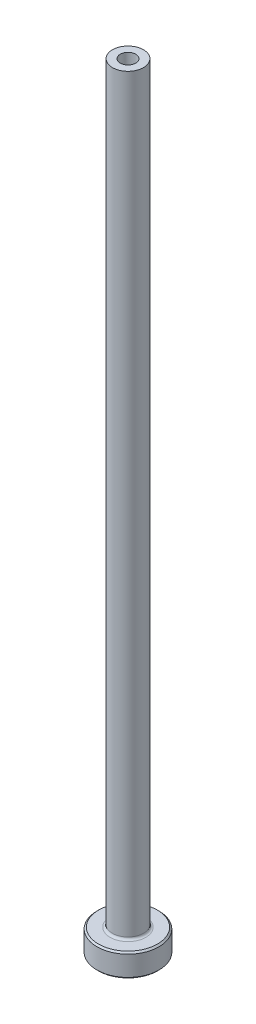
from build123d import *

# Parameters (mm, degrees)
FILLET1_R     = 0.3
CHAMFER1_SIZE = 0.2
CHAMFER3_SIZE = 0.5


with BuildPart() as part:
    # Sketch1 → Revolve1 (revolve)
    with BuildSketch(Plane.XY, mode=Mode.PRIVATE) as revolve1_sk:
        Polygon((-1, 100), (-2, 100), (-2, 3), (-4, 3), (-4, 0), (-1.25, 0), (-1.25, 53), (-1, 65), align=None)
    revolve(revolve1_sk.sketch.rotate(Axis((0, 92.187680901, 0), (0, -1, 0)), 270), axis=Axis((0, 92.187680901, 0), (0, -1, 0)))

    # Fillet1
    fillet1_edges = [part.edges().sort_by_distance(p)[0] for p in [
        (0, 3, -2),
    ]]
    fillet(fillet1_edges, radius=FILLET1_R)

    # Chamfer1
    chamfer1_edges = [part.edges().sort_by_distance(p)[0] for p in [
        (0, 0, -4),
        (0, 3, -4),
    ]]
    chamfer(chamfer1_edges, length=CHAMFER1_SIZE)

    # Chamfer3
    chamfer3_edges = [part.edges().sort_by_distance(p)[0] for p in [
        (0, 0, -1.25),
    ]]
    chamfer(chamfer3_edges, length=CHAMFER3_SIZE)


solid = part.part
